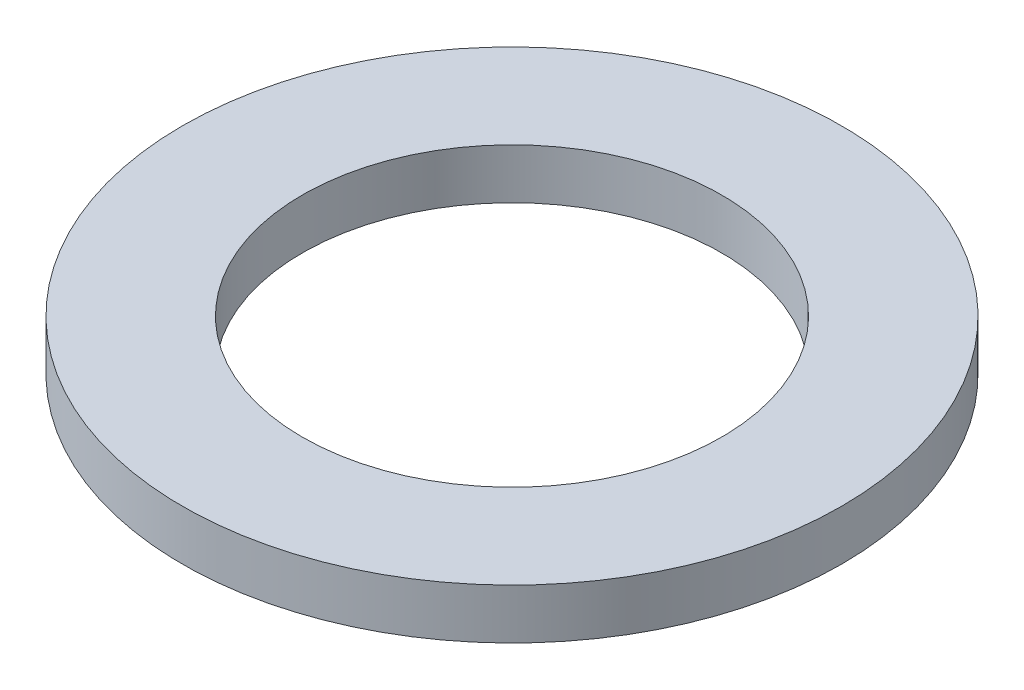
from build123d import *

# Parameters (mm, degrees)
SKETCH1_R           = 22
SKETCH1_R_2         = 14
EXTRUDE_THIN1_DEPTH = 3.35


with BuildPart() as part:
    # Sketch1 → Extrude-Thin1 (new body)
    with BuildSketch(Plane(origin=(0, 0, 0), x_dir=(1, 0, 0), z_dir=(0, 1, 0))):
        Circle(SKETCH1_R)
        Circle(SKETCH1_R_2, mode=Mode.SUBTRACT)
    extrude(amount=EXTRUDE_THIN1_DEPTH)


solid = part.part
